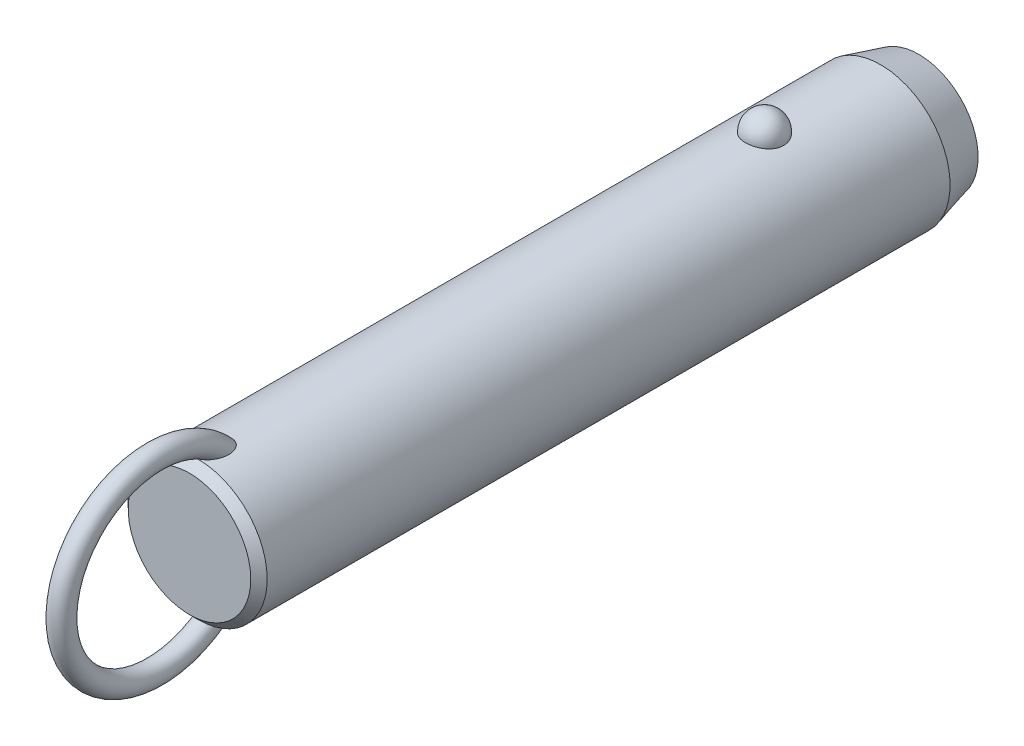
ISO-10303-21;
HEADER;
FILE_DESCRIPTION(('STEP AP214'),'2;1');
FILE_NAME('part.step','',(''),(''),'','','');
FILE_SCHEMA(('AUTOMOTIVE_DESIGN { 1 0 10303 214 1 1 1 1 }'));
ENDSEC;
DATA;
#1=APPLICATION_CONTEXT('core data for automotive mechanical design processes');
#2=APPLICATION_PROTOCOL_DEFINITION('international standard','automotive_design',2000,#1);
#3=PRODUCT_CONTEXT('',#1,'mechanical');
#4=PRODUCT('Part','Part','',(#3));
#5=PRODUCT_RELATED_PRODUCT_CATEGORY('part','',(#4));
#6=PRODUCT_DEFINITION_FORMATION('','',#4);
#7=PRODUCT_DEFINITION_CONTEXT('part definition',#1,'design');
#8=PRODUCT_DEFINITION('design','',#6,#7);
#9=PRODUCT_DEFINITION_SHAPE('','',#8);
#10=(LENGTH_UNIT() NAMED_UNIT(*) SI_UNIT(.MILLI.,.METRE.));
#11=(NAMED_UNIT(*) PLANE_ANGLE_UNIT() SI_UNIT($,.RADIAN.));
#12=(NAMED_UNIT(*) SI_UNIT($,.STERADIAN.) SOLID_ANGLE_UNIT());
#13=UNCERTAINTY_MEASURE_WITH_UNIT(LENGTH_MEASURE(1.E-05),#10,'distance_accuracy_value','');
#14=(GEOMETRIC_REPRESENTATION_CONTEXT(3) GLOBAL_UNCERTAINTY_ASSIGNED_CONTEXT((#13)) GLOBAL_UNIT_ASSIGNED_CONTEXT((#10,
#11,#12)) REPRESENTATION_CONTEXT('',''));
#15=CARTESIAN_POINT('',(0.,0.,0.));
#16=DIRECTION('',(0.,0.,1.));
#17=DIRECTION('',(1.,0.,0.));
#18=AXIS2_PLACEMENT_3D('',#15,#16,#17);
#19=CARTESIAN_POINT('',(0.,0.,88.9));
#20=DIRECTION('',(0.,0.,-1.));
#21=DIRECTION('',(-1.,0.,0.));
#22=AXIS2_PLACEMENT_3D('',#19,#20,#21);
#23=CYLINDRICAL_SURFACE('',#22,12.7);
#24=CARTESIAN_POINT('',(3.46661256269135,12.2177165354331,-3.5));
#25=CARTESIAN_POINT('',(3.4666090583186,12.2177194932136,-3.30432790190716));
#26=CARTESIAN_POINT('',(3.45063567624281,12.2222841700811,-3.10861112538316));
#27=CARTESIAN_POINT('',(3.38712451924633,12.2400345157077,-2.72271899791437));
#28=CARTESIAN_POINT('',(3.33957415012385,12.2532236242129,-2.53254588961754));
#29=CARTESIAN_POINT('',(3.2141234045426,12.286724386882,-2.16324948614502));
#30=CARTESIAN_POINT('',(3.13623639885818,12.3070329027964,-1.98412136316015));
#31=CARTESIAN_POINT('',(2.95205930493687,12.3525018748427,-1.64180592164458));
#32=CARTESIAN_POINT('',(2.84577003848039,12.3776621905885,-1.47861814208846));
#33=CARTESIAN_POINT('',(2.60688050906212,12.4301712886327,-1.17190583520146));
#34=CARTESIAN_POINT('',(2.47415697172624,12.4575299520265,-1.02847897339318));
#35=CARTESIAN_POINT('',(2.18615174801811,12.5112810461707,-0.766177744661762));
#36=CARTESIAN_POINT('',(2.03087002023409,12.5376734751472,-0.64730342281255));
#37=CARTESIAN_POINT('',(1.70237334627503,12.5864761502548,-0.437732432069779));
#38=CARTESIAN_POINT('',(1.52920948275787,12.6088972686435,-0.346958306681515));
#39=CARTESIAN_POINT('',(1.16944170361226,12.6473352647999,-0.195750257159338));
#40=CARTESIAN_POINT('',(0.982839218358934,12.663352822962,-0.135313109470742));
#41=CARTESIAN_POINT('',(0.604961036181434,12.6869706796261,-0.0473241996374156));
#42=CARTESIAN_POINT('',(0.41382314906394,12.6947125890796,-0.0192185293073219));
#43=CARTESIAN_POINT('',(0.0293827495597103,12.7014203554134,0.0051725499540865));
#44=CARTESIAN_POINT('',(-0.163919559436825,12.7003870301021,0.00146092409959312));
#45=CARTESIAN_POINT('',(-0.544374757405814,12.689735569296,-0.0373939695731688));
#46=CARTESIAN_POINT('',(-0.731575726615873,12.6802364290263,-0.0721015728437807));
#47=CARTESIAN_POINT('',(-1.09733277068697,12.6538333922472,-0.171364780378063));
#48=CARTESIAN_POINT('',(-1.27588869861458,12.6369293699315,-0.235920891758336));
#49=CARTESIAN_POINT('',(-1.6204698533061,12.5973946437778,-0.393548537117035));
#50=CARTESIAN_POINT('',(-1.78641865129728,12.5747321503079,-0.486778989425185));
#51=CARTESIAN_POINT('',(-2.10030671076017,12.5261316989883,-0.699110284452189));
#52=CARTESIAN_POINT('',(-2.24824419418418,12.5001934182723,-0.818213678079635));
#53=CARTESIAN_POINT('',(-2.52491489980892,12.4472906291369,-1.08157124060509));
#54=CARTESIAN_POINT('',(-2.65324222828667,12.4203160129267,-1.22624992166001));
#55=CARTESIAN_POINT('',(-2.88410007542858,12.3687509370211,-1.53528325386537));
#56=CARTESIAN_POINT('',(-2.98662883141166,12.3441606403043,-1.69963924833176));
#57=CARTESIAN_POINT('',(-3.16432417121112,12.2998199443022,-2.04548497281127));
#58=CARTESIAN_POINT('',(-3.23917525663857,12.2801261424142,-2.22714424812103));
#59=CARTESIAN_POINT('',(-3.35800573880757,12.248167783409,-2.6009138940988));
#60=CARTESIAN_POINT('',(-3.4019860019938,12.2359030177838,-2.79302397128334));
#61=CARTESIAN_POINT('',(-3.45784812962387,12.2202347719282,-3.18140279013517));
#62=CARTESIAN_POINT('',(-3.46986123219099,12.2167950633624,-3.37765118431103));
#63=CARTESIAN_POINT('',(-3.46186273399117,12.2190638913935,-3.76943689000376));
#64=CARTESIAN_POINT('',(-3.44185196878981,12.2247721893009,-3.96497421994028));
#65=CARTESIAN_POINT('',(-3.37048652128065,12.2446381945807,-4.34881728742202));
#66=CARTESIAN_POINT('',(-3.31928253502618,12.2587552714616,-4.53715319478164));
#67=CARTESIAN_POINT('',(-3.18693461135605,12.2938237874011,-4.90231727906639));
#68=CARTESIAN_POINT('',(-3.1057895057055,12.3147754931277,-5.07914500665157));
#69=CARTESIAN_POINT('',(-2.91506431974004,12.3613125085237,-5.41732059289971));
#70=CARTESIAN_POINT('',(-2.80533587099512,12.3869217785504,-5.57858147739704));
#71=CARTESIAN_POINT('',(-2.560414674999,12.4398525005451,-5.88013283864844));
#72=CARTESIAN_POINT('',(-2.42522099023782,12.4671740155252,-6.02042254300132));
#73=CARTESIAN_POINT('',(-2.1323357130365,12.5205965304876,-6.27662798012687));
#74=CARTESIAN_POINT('',(-1.97456596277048,12.5466928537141,-6.3924554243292));
#75=CARTESIAN_POINT('',(-1.64115839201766,12.5946384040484,-6.59583547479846));
#76=CARTESIAN_POINT('',(-1.46552179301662,12.6164879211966,-6.68339001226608));
#77=CARTESIAN_POINT('',(-1.10356050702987,12.6532533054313,-6.82682153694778));
#78=CARTESIAN_POINT('',(-0.9173913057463,12.6682500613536,-6.8830698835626));
#79=CARTESIAN_POINT('',(-0.537836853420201,12.6900288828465,-6.96386887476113));
#80=CARTESIAN_POINT('',(-0.344452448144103,12.6968119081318,-6.9884232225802));
#81=CARTESIAN_POINT('',(0.0402577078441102,12.7013667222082,-7.00496469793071));
#82=CARTESIAN_POINT('',(0.231556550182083,12.6993008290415,-6.99753844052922));
#83=CARTESIAN_POINT('',(0.610105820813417,12.6867505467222,-6.9516636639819));
#84=CARTESIAN_POINT('',(0.797356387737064,12.6762664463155,-6.913216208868));
#85=CARTESIAN_POINT('',(1.16186657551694,12.6480587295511,-6.80658431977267));
#86=CARTESIAN_POINT('',(1.33915951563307,12.6303611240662,-6.73850666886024));
#87=CARTESIAN_POINT('',(1.67968518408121,12.5896027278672,-6.5745087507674));
#88=CARTESIAN_POINT('',(1.84291705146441,12.5665416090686,-6.47858678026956));
#89=CARTESIAN_POINT('',(2.15340192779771,12.5171072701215,-6.25982455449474));
#90=CARTESIAN_POINT('',(2.30037831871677,12.4906895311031,-6.13660186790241));
#91=CARTESIAN_POINT('',(2.5717412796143,12.4376567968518,-5.86739587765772));
#92=CARTESIAN_POINT('',(2.69612388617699,12.4110417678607,-5.72140858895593));
#93=CARTESIAN_POINT('',(2.92107785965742,12.360051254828,-5.40794137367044));
#94=CARTESIAN_POINT('',(3.02121329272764,12.3357209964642,-5.24014110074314));
#95=CARTESIAN_POINT('',(3.19236291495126,12.2925446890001,-4.88969865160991));
#96=CARTESIAN_POINT('',(3.26338839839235,12.2736965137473,-4.70706226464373));
#97=CARTESIAN_POINT('',(3.36788038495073,12.245404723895,-4.35469510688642));
#98=CARTESIAN_POINT('',(3.40484026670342,12.2351018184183,-4.18605935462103));
#99=CARTESIAN_POINT('',(3.45420764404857,12.2212564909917,-3.84496058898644));
#100=CARTESIAN_POINT('',(3.46661565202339,12.2177139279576,-3.67249765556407));
#101=CARTESIAN_POINT('',(3.46661256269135,12.2177165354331,-3.5));
#102=B_SPLINE_CURVE_WITH_KNOTS('',3,(#24,#25,#26,#27,#28,#29,#30,#31,#32,#33,#34,#35,#36,#37,
#38,#39,#40,#41,#42,#43,#44,#45,#46,#47,#48,#49,#50,#51,#52,#53,#54,#55,#56,#57,#58,#59,#60,#61,
#62,#63,#64,#65,#66,#67,#68,#69,#70,#71,#72,#73,#74,#75,#76,#77,#78,#79,#80,#81,#82,#83,#84,#85,
#86,#87,#88,#89,#90,#91,#92,#93,#94,#95,#96,#97,#98,#99,#100,#101),.UNSPECIFIED.,.T.,.F.,(4,2,2,
2,2,2,2,2,2,2,2,2,2,2,2,2,2,2,2,2,2,2,2,2,2,2,2,2,2,2,2,2,2,2,2,2,2,2,4),(0.,0.586396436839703,
1.17302689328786,1.7593990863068,2.34575431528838,2.93491084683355,3.52406845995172,
4.11158733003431,4.69904375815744,5.2762784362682,5.85345931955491,6.42265312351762,
6.99185659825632,7.56427334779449,8.136746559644,8.71981013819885,9.3029135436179,
9.89247258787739,10.4820150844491,11.0691335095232,11.6562366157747,12.2405256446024,
12.8248374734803,13.412244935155,13.9996740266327,14.5891883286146,15.1786623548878,
15.7609861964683,16.3432419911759,16.9148635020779,17.4864654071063,18.0560241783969,
18.6256177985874,19.2037609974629,19.7820055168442,20.3699810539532,20.957728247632,
21.4746855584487,21.9916320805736),.UNSPECIFIED.);
#103=CARTESIAN_POINT('',(3.46661256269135,12.2177165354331,-3.5));
#104=VERTEX_POINT('',#103);
#105=EDGE_CURVE('E41',#104,#104,#102,.T.);
#106=ORIENTED_EDGE('',*,*,#105,.T.);
#107=EDGE_LOOP('',(#106));
#108=FACE_BOUND('',#107,.T.);
#109=CARTESIAN_POINT('',(0.,0.,100.1));
#110=DIRECTION('',(0.,0.,1.));
#111=DIRECTION('',(1.,0.,0.));
#112=AXIS2_PLACEMENT_3D('',#109,#110,#111);
#113=CIRCLE('',#112,12.7);
#114=CARTESIAN_POINT('',(12.7,0.,100.1));
#115=VERTEX_POINT('',#114);
#116=EDGE_CURVE('E10',#115,#115,#113,.F.);
#117=ORIENTED_EDGE('',*,*,#116,.T.);
#118=EDGE_LOOP('',(#117));
#119=FACE_BOUND('',#118,.T.);
#120=CARTESIAN_POINT('',(-0.548122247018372,-12.6881662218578,93.8432187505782));
#121=CARTESIAN_POINT('',(-0.648865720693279,-12.6838128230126,93.877926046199));
#122=CARTESIAN_POINT('',(-0.746398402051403,-12.6783867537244,93.9220428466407));
#123=CARTESIAN_POINT('',(-0.93212506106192,-12.666091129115,94.0267647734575));
#124=CARTESIAN_POINT('',(-1.02030388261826,-12.6592192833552,94.087396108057));
#125=CARTESIAN_POINT('',(-1.18487740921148,-12.6448747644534,94.221847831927));
#126=CARTESIAN_POINT('',(-1.26134296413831,-12.637406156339,94.2955825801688));
#127=CARTESIAN_POINT('',(-1.4023120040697,-12.6225412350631,94.4536045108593));
#128=CARTESIAN_POINT('',(-1.46681470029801,-12.6151449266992,94.5378923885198));
#129=CARTESIAN_POINT('',(-1.60714786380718,-12.5981718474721,94.7496577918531));
#130=CARTESIAN_POINT('',(-1.67725126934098,-12.588900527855,94.880962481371));
#131=CARTESIAN_POINT('',(-1.79536591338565,-12.5725964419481,95.1532471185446));
#132=CARTESIAN_POINT('',(-1.84333535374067,-12.5655679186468,95.2942447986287));
#133=CARTESIAN_POINT('',(-1.93422576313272,-12.5519624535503,95.6376455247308));
#134=CARTESIAN_POINT('',(-1.96788773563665,-12.5466298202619,95.8425578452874));
#135=CARTESIAN_POINT('',(-1.9941399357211,-12.542463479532,96.1517600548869));
#136=CARTESIAN_POINT('',(-1.99883864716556,-12.5417153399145,96.2552987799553));
#137=CARTESIAN_POINT('',(-2.00078003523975,-12.5414074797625,96.4624512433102));
#138=CARTESIAN_POINT('',(-1.99802449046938,-12.5418474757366,96.5660649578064));
#139=CARTESIAN_POINT('',(-1.98336733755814,-12.5441750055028,96.8103207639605));
#140=CARTESIAN_POINT('',(-1.96851430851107,-12.5465291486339,96.9507804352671));
#141=CARTESIAN_POINT('',(-1.92707089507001,-12.5529612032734,97.2299607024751));
#142=CARTESIAN_POINT('',(-1.90047458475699,-12.5570399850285,97.3686803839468));
#143=CARTESIAN_POINT('',(-1.83619120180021,-12.5666008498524,97.6434113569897));
#144=CARTESIAN_POINT('',(-1.79850828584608,-12.57208240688,97.7794236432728));
#145=CARTESIAN_POINT('',(-1.71223796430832,-12.5841228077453,98.0478421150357));
#146=CARTESIAN_POINT('',(-1.66365679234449,-12.5906810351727,98.1802503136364));
#147=CARTESIAN_POINT('',(-1.5780450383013,-12.6016176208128,98.3854887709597));
#148=CARTESIAN_POINT('',(-1.54477252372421,-12.6057501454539,98.4599149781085));
#149=CARTESIAN_POINT('',(-1.47424480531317,-12.6141930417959,98.6068393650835));
#150=CARTESIAN_POINT('',(-1.43699041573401,-12.6185033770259,98.6793379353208));
#151=CARTESIAN_POINT('',(-1.35825795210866,-12.6272207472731,98.8218926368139));
#152=CARTESIAN_POINT('',(-1.31678520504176,-12.6316276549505,98.8919517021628));
#153=CARTESIAN_POINT('',(-1.22917793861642,-12.6404532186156,99.0290705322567));
#154=CARTESIAN_POINT('',(-1.18304514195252,-12.6448718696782,99.0961313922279));
#155=CARTESIAN_POINT('',(-1.07246411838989,-12.6547893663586,99.2438741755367));
#156=CARTESIAN_POINT('',(-1.00642239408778,-12.6602600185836,99.3233844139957));
#157=CARTESIAN_POINT('',(-0.864441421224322,-12.6707460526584,99.4731698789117));
#158=CARTESIAN_POINT('',(-0.788516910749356,-12.6757620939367,99.5434585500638));
#159=CARTESIAN_POINT('',(-0.652215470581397,-12.6833591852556,99.6486801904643));
#160=CARTESIAN_POINT('',(-0.594982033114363,-12.6861973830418,99.6876241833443));
#161=CARTESIAN_POINT('',(-0.475269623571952,-12.6912445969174,99.7564899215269));
#162=CARTESIAN_POINT('',(-0.412800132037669,-12.6934547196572,99.7864275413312));
#163=CARTESIAN_POINT('',(-0.295749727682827,-12.6966636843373,99.8297565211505));
#164=CARTESIAN_POINT('',(-0.241949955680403,-12.6978134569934,99.8452188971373));
#165=CARTESIAN_POINT('',(-0.132508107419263,-12.6994261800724,99.8668845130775));
#166=CARTESIAN_POINT('',(-0.0768679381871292,-12.6998898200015,99.8730970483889));
#167=CARTESIAN_POINT('',(0.0347696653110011,-12.7000752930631,99.8755838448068));
#168=CARTESIAN_POINT('',(0.0907676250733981,-12.6997954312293,99.8718353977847));
#169=CARTESIAN_POINT('',(0.201283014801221,-12.6985255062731,99.8547883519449));
#170=CARTESIAN_POINT('',(0.255799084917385,-12.6975348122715,99.8414812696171));
#171=CARTESIAN_POINT('',(0.376042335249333,-12.6946091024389,99.8020379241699));
#172=CARTESIAN_POINT('',(0.44095085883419,-12.6924943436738,99.7734492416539));
#173=CARTESIAN_POINT('',(0.565350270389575,-12.6875639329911,99.7063234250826));
#174=CARTESIAN_POINT('',(0.624828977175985,-12.6847467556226,99.6677646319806));
#175=CARTESIAN_POINT('',(0.774116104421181,-12.6767252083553,99.556949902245));
#176=CARTESIAN_POINT('',(0.859449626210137,-12.6711344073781,99.4787605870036));
#177=CARTESIAN_POINT('',(1.01789440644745,-12.6593922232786,99.310943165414));
#178=CARTESIAN_POINT('',(1.09096902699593,-12.653239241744,99.221282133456));
#179=CARTESIAN_POINT('',(1.22268793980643,-12.6411674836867,99.0402658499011));
#180=CARTESIAN_POINT('',(1.28193986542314,-12.6352572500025,98.949345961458));
#181=CARTESIAN_POINT('',(1.39259777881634,-12.6235401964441,98.7627929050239));
#182=CARTESIAN_POINT('',(1.44399707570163,-12.6177334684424,98.6671558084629));
#183=CARTESIAN_POINT('',(1.53972870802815,-12.6064093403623,98.4722738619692));
#184=CARTESIAN_POINT('',(1.58405262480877,-12.6008922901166,98.3730248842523));
#185=CARTESIAN_POINT('',(1.66600705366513,-12.5903187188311,98.1717727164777));
#186=CARTESIAN_POINT('',(1.70363651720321,-12.5852622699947,98.0697690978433));
#187=CARTESIAN_POINT('',(1.77545379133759,-12.5753406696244,97.8543580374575));
#188=CARTESIAN_POINT('',(1.80903453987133,-12.5705328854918,97.740745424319));
#189=CARTESIAN_POINT('',(1.86844163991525,-12.5618400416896,97.5114575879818));
#190=CARTESIAN_POINT('',(1.89426665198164,-12.5579551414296,97.3957820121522));
#191=CARTESIAN_POINT('',(1.9378546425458,-12.5513030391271,97.1630072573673));
#192=CARTESIAN_POINT('',(1.9556264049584,-12.5485346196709,97.0459097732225));
#193=CARTESIAN_POINT('',(1.98264463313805,-12.5442934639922,96.8107473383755));
#194=CARTESIAN_POINT('',(1.99189298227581,-12.5428204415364,96.6926826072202));
#195=CARTESIAN_POINT('',(2.00416068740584,-12.540871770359,96.3806225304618));
#196=CARTESIAN_POINT('',(1.99944433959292,-12.541631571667,96.1862290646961));
#197=CARTESIAN_POINT('',(1.96113755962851,-12.5476846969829,95.8003095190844));
#198=CARTESIAN_POINT('',(1.92758341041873,-12.5529723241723,95.6087801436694));
#199=CARTESIAN_POINT('',(1.83934342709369,-12.5661532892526,95.2822728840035));
#200=CARTESIAN_POINT('',(1.79215440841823,-12.5730485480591,95.1452499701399));
#201=CARTESIAN_POINT('',(1.67676242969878,-12.588958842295,94.8804459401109));
#202=CARTESIAN_POINT('',(1.60859050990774,-12.597970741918,94.7526515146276));
#203=CARTESIAN_POINT('',(1.46583832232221,-12.6152829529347,94.5358006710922));
#204=CARTESIAN_POINT('',(1.39525727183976,-12.6233659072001,94.4441050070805));
#205=CARTESIAN_POINT('',(1.23992594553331,-12.6395676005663,94.2734854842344));
#206=CARTESIAN_POINT('',(1.1551793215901,-12.6476863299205,94.1945583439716));
#207=CARTESIAN_POINT('',(0.971995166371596,-12.6630846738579,94.0526438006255));
#208=CARTESIAN_POINT('',(0.873456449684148,-12.6703572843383,93.9897849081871));
#209=CARTESIAN_POINT('',(0.665847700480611,-12.6829569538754,93.8844870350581));
#210=CARTESIAN_POINT('',(0.556784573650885,-12.688285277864,93.8420347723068));
#211=CARTESIAN_POINT('',(0.347338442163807,-12.6956226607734,93.7844434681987));
#212=CARTESIAN_POINT('',(0.247759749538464,-12.6979816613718,93.7663996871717));
#213=CARTESIAN_POINT('',(0.0470218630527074,-12.7003077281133,93.7486007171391));
#214=CARTESIAN_POINT('',(-0.0541350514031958,-12.7002779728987,93.7488212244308));
#215=CARTESIAN_POINT('',(-0.221414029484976,-12.6982482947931,93.7643639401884));
#216=CARTESIAN_POINT('',(-0.288055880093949,-12.6969033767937,93.7746662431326));
#217=CARTESIAN_POINT('',(-0.419599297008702,-12.6932369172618,93.8031348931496));
#218=CARTESIAN_POINT('',(-0.484501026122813,-12.6909154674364,93.8213005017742));
#219=CARTESIAN_POINT('',(-0.548122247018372,-12.6881662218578,93.8432187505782));
#220=B_SPLINE_CURVE_WITH_KNOTS('',3,(#120,#121,#122,#123,#124,#125,#126,#127,#128,#129,#130,
#131,#132,#133,#134,#135,#136,#137,#138,#139,#140,#141,#142,#143,#144,#145,#146,#147,#148,#149,
#150,#151,#152,#153,#154,#155,#156,#157,#158,#159,#160,#161,#162,#163,#164,#165,#166,#167,#168,
#169,#170,#171,#172,#173,#174,#175,#176,#177,#178,#179,#180,#181,#182,#183,#184,#185,#186,#187,
#188,#189,#190,#191,#192,#193,#194,#195,#196,#197,#198,#199,#200,#201,#202,#203,#204,#205,#206,
#207,#208,#209,#210,#211,#212,#213,#214,#215,#216,#217,#218,#219),.UNSPECIFIED.,.T.,.F.,(4,2,2,
2,2,2,2,2,2,2,2,2,2,2,2,2,2,2,2,2,2,2,2,2,2,2,2,2,2,2,2,2,2,2,2,2,2,2,2,2,2,2,2,2,2,2,2,2,2,4),
(0.,0.31964225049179,0.639794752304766,0.957927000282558,1.27608021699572,1.72100165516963,
2.16675988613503,2.78630021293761,3.09705782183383,3.40774128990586,3.83096358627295,
4.2543996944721,4.67767724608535,5.10071330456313,5.34550297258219,5.59024267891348,
5.83467707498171,6.07902143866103,6.38891080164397,6.69834321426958,6.90560910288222,
7.11250749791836,7.27977315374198,7.44687060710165,7.61434932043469,7.78197685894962,
7.99365544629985,8.20579780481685,8.55147335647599,8.89816429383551,9.22375138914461,
9.5496143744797,9.87586224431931,10.202161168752,10.557587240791,10.9130746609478,
11.2681734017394,11.6231936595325,12.2046601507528,12.7853961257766,13.219164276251,
13.6522938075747,13.9989174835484,14.3454519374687,14.6946768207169,15.0436740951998,
15.3457513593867,15.6474266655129,15.8493051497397,16.0511646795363),.UNSPECIFIED.);
#221=CARTESIAN_POINT('',(-0.548122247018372,-12.6881662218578,93.8432187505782));
#222=VERTEX_POINT('',#221);
#223=EDGE_CURVE('E58',#222,#222,#220,.T.);
#224=ORIENTED_EDGE('',*,*,#223,.T.);
#225=EDGE_LOOP('',(#224));
#226=FACE_BOUND('',#225,.T.);
#227=CARTESIAN_POINT('',(-0.548122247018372,12.6881662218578,93.8432187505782));
#228=CARTESIAN_POINT('',(-0.459436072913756,12.6919968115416,93.812673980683));
#229=CARTESIAN_POINT('',(-0.368189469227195,12.6949996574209,93.7893913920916));
#230=CARTESIAN_POINT('',(-0.183024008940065,12.6990186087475,93.7584062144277));
#231=CARTESIAN_POINT('',(-0.0891049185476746,12.7000345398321,93.7507049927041));
#232=CARTESIAN_POINT('',(0.0987147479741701,12.6999636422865,93.7512455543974));
#233=CARTESIAN_POINT('',(0.192615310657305,12.6988761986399,93.7594920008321));
#234=CARTESIAN_POINT('',(0.377658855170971,12.6947211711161,93.7915515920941));
#235=CARTESIAN_POINT('',(0.468801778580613,12.6916535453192,93.8153650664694));
#236=CARTESIAN_POINT('',(0.645809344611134,12.6838788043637,93.8774565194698));
#237=CARTESIAN_POINT('',(0.731679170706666,12.6791733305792,93.915720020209));
#238=CARTESIAN_POINT('',(0.896315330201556,12.6686004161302,94.0051204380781));
#239=CARTESIAN_POINT('',(0.975080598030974,12.6627328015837,94.0562592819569));
#240=CARTESIAN_POINT('',(1.12963655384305,12.6499161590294,94.1736782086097));
#241=CARTESIAN_POINT('',(1.20478673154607,12.6429194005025,94.2407929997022));
#242=CARTESIAN_POINT('',(1.34448241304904,12.6288282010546,94.3852250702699));
#243=CARTESIAN_POINT('',(1.40902173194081,12.621733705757,94.4625482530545));
#244=CARTESIAN_POINT('',(1.55208211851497,12.6050877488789,94.6592475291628));
#245=CARTESIAN_POINT('',(1.62510490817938,12.5957546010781,94.7826540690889));
#246=CARTESIAN_POINT('',(1.75019044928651,12.5789823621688,95.0397690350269));
#247=CARTESIAN_POINT('',(1.80221377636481,12.5715468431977,95.173496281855));
#248=CARTESIAN_POINT('',(1.90309965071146,12.5567434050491,95.4983516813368));
#249=CARTESIAN_POINT('',(1.94342317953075,12.5504515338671,95.6921611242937));
#250=CARTESIAN_POINT('',(1.99332997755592,12.5426147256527,96.0837881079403));
#251=CARTESIAN_POINT('',(2.00285305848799,12.5410790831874,96.2816127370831));
#252=CARTESIAN_POINT('',(1.99678999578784,12.5420407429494,96.6166427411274));
#253=CARTESIAN_POINT('',(1.98794117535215,12.5434564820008,96.7540428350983));
#254=CARTESIAN_POINT('',(1.95865119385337,12.5480641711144,97.0276394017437));
#255=CARTESIAN_POINT('',(1.93820436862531,12.5512569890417,97.1638352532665));
#256=CARTESIAN_POINT('',(1.88647896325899,12.5591352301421,97.4342493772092));
#257=CARTESIAN_POINT('',(1.85518800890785,12.5638223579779,97.5684652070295));
#258=CARTESIAN_POINT('',(1.78217886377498,12.5743868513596,97.8339362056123));
#259=CARTESIAN_POINT('',(1.74046509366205,12.5802637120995,97.9651926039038));
#260=CARTESIAN_POINT('',(1.66024095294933,12.5910571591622,98.1860855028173));
#261=CARTESIAN_POINT('',(1.62434772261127,12.5957535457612,98.2766904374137));
#262=CARTESIAN_POINT('',(1.5470900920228,12.6054762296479,98.4555125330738));
#263=CARTESIAN_POINT('',(1.50572681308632,12.6105024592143,98.5437301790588));
#264=CARTESIAN_POINT('',(1.41728020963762,12.620748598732,98.7169321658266));
#265=CARTESIAN_POINT('',(1.37021377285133,12.625967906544,98.8019251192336));
#266=CARTESIAN_POINT('',(1.2696962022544,12.6364721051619,98.9680072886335));
#267=CARTESIAN_POINT('',(1.21624929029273,12.6417569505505,99.0490990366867));
#268=CARTESIAN_POINT('',(1.10304413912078,12.6521331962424,99.2047027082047));
#269=CARTESIAN_POINT('',(1.04340936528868,12.657226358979,99.2793033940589));
#270=CARTESIAN_POINT('',(0.91591933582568,12.6670906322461,99.421324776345));
#271=CARTESIAN_POINT('',(0.84806456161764,12.6718617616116,99.4887458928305));
#272=CARTESIAN_POINT('',(0.717035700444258,12.67987711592,99.6006247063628));
#273=CARTESIAN_POINT('',(0.655526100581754,12.6832377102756,99.6469970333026));
#274=CARTESIAN_POINT('',(0.525985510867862,12.6892676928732,99.7296195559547));
#275=CARTESIAN_POINT('',(0.45796984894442,12.6919386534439,99.7658927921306));
#276=CARTESIAN_POINT('',(0.334859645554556,12.695691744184,99.8166572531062));
#277=CARTESIAN_POINT('',(0.281116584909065,12.6970073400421,99.8343733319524));
#278=CARTESIAN_POINT('',(0.171425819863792,12.6989609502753,99.8606429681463));
#279=CARTESIAN_POINT('',(0.11548082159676,12.699599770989,99.8692074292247));
#280=CARTESIAN_POINT('',(0.00272618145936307,12.7001251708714,99.8762531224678));
#281=CARTESIAN_POINT('',(-0.0540859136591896,12.7000089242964,99.8746964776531));
#282=CARTESIAN_POINT('',(-0.166544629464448,12.6990328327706,99.8616005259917));
#283=CARTESIAN_POINT('',(-0.222190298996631,12.6981724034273,99.8500533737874));
#284=CARTESIAN_POINT('',(-0.342018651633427,12.695562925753,99.8149128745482));
#285=CARTESIAN_POINT('',(-0.405606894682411,12.6936676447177,99.7893322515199));
#286=CARTESIAN_POINT('',(-0.527815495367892,12.6891754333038,99.728311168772));
#287=CARTESIAN_POINT('',(-0.586425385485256,12.6865770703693,99.6928505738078));
#288=CARTESIAN_POINT('',(-0.731842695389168,12.6792129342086,99.5914960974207));
#289=CARTESIAN_POINT('',(-0.814709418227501,12.6740767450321,99.5200395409));
#290=CARTESIAN_POINT('',(-0.969101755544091,12.6632083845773,99.3658900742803));
#291=CARTESIAN_POINT('',(-1.04059564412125,12.6574746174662,99.2831668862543));
#292=CARTESIAN_POINT('',(-1.16981116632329,12.6461638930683,99.1158096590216));
#293=CARTESIAN_POINT('',(-1.22811369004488,12.6405994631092,99.0316166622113));
#294=CARTESIAN_POINT('',(-1.33743405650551,12.6295007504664,98.8585791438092));
#295=CARTESIAN_POINT('',(-1.38844577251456,12.6239664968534,98.7697307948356));
#296=CARTESIAN_POINT('',(-1.48400702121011,12.6130898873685,98.588389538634));
#297=CARTESIAN_POINT('',(-1.52854232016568,12.6077479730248,98.4958891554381));
#298=CARTESIAN_POINT('',(-1.6115011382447,12.5974127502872,98.3081607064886));
#299=CARTESIAN_POINT('',(-1.64992317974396,12.5924195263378,98.2129319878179));
#300=CARTESIAN_POINT('',(-1.73468589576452,12.581070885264,97.9828936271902));
#301=CARTESIAN_POINT('',(-1.77831261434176,12.5749388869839,97.8470661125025));
#302=CARTESIAN_POINT('',(-1.85439734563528,12.5639437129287,97.5722128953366));
#303=CARTESIAN_POINT('',(-1.88684994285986,12.5590811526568,97.4331856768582));
#304=CARTESIAN_POINT('',(-1.94008483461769,12.550968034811,97.1530923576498));
#305=CARTESIAN_POINT('',(-1.96088706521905,12.5477147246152,97.0120301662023));
#306=CARTESIAN_POINT('',(-1.99000539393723,12.5431291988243,96.7286689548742));
#307=CARTESIAN_POINT('',(-1.99832911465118,12.5417958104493,96.5863707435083));
#308=CARTESIAN_POINT('',(-2.00166624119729,12.5412674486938,96.2576271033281));
#309=CARTESIAN_POINT('',(-1.99178843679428,12.5428579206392,96.071088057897));
#310=CARTESIAN_POINT('',(-1.9445518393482,12.5502731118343,95.7016240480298));
#311=CARTESIAN_POINT('',(-1.90724032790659,12.5560905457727,95.5186934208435));
#312=CARTESIAN_POINT('',(-1.81330718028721,12.5699462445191,95.2048488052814));
#313=CARTESIAN_POINT('',(-1.76338820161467,12.5771273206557,95.0719105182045));
#314=CARTESIAN_POINT('',(-1.64305018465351,12.593414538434,94.8156813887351));
#315=CARTESIAN_POINT('',(-1.57265346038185,12.6025185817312,94.692380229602));
#316=CARTESIAN_POINT('',(-1.42634956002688,12.6198178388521,94.4835648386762));
#317=CARTESIAN_POINT('',(-1.35423772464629,12.6278405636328,94.3953846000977));
#318=CARTESIAN_POINT('',(-1.19645664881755,12.6437632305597,94.232107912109));
#319=CARTESIAN_POINT('',(-1.11080536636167,12.6516633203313,94.1569944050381));
#320=CARTESIAN_POINT('',(-0.947219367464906,12.6648319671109,94.0378114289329));
#321=CARTESIAN_POINT('',(-0.871624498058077,12.670300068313,93.9905414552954));
#322=CARTESIAN_POINT('',(-0.714161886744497,12.6801492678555,93.9077413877));
#323=CARTESIAN_POINT('',(-0.632295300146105,12.684530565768,93.8722091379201));
#324=CARTESIAN_POINT('',(-0.548122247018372,12.6881662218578,93.8432187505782));
#325=B_SPLINE_CURVE_WITH_KNOTS('',3,(#227,#228,#229,#230,#231,#232,#233,#234,#235,#236,#237,
#238,#239,#240,#241,#242,#243,#244,#245,#246,#247,#248,#249,#250,#251,#252,#253,#254,#255,#256,
#257,#258,#259,#260,#261,#262,#263,#264,#265,#266,#267,#268,#269,#270,#271,#272,#273,#274,#275,
#276,#277,#278,#279,#280,#281,#282,#283,#284,#285,#286,#287,#288,#289,#290,#291,#292,#293,#294,
#295,#296,#297,#298,#299,#300,#301,#302,#303,#304,#305,#306,#307,#308,#309,#310,#311,#312,#313,
#314,#315,#316,#317,#318,#319,#320,#321,#322,#323,#324),.UNSPECIFIED.,.T.,.F.,(4,2,2,2,2,2,2,2,
2,2,2,2,2,2,2,2,2,2,2,2,2,2,2,2,2,2,2,2,2,2,2,2,2,2,2,2,2,2,2,2,2,2,2,2,2,2,2,2,4),(0.,
0.281328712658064,0.562682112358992,0.844117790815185,1.12555942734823,1.40671982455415,
1.68792232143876,1.98972294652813,2.29169886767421,2.72039860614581,3.14989948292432,
3.74084916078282,4.33295293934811,4.74554109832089,5.15833092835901,5.57159335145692,
5.98468079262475,6.2772277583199,6.56971484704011,6.86135609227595,7.15280542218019,
7.43927407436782,7.72572595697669,7.95635862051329,8.18646071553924,8.35559393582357,
8.52452541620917,8.69408946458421,8.86378678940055,9.06834348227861,9.27332014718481,
9.60010414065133,9.92778432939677,10.2350252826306,10.5425229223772,10.8506864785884,
11.1589244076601,11.5867893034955,12.0148612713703,12.4421984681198,12.8692745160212,
13.4279365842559,13.9856380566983,14.4107062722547,14.8353130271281,15.1765567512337,
15.5173516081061,15.7844129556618,16.051425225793),.UNSPECIFIED.);
#326=CARTESIAN_POINT('',(-0.548122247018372,12.6881662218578,93.8432187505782));
#327=VERTEX_POINT('',#326);
#328=EDGE_CURVE('E66',#327,#327,#325,.T.);
#329=ORIENTED_EDGE('',*,*,#328,.T.);
#330=EDGE_LOOP('',(#329));
#331=FACE_BOUND('',#330,.T.);
#332=CARTESIAN_POINT('',(0.,0.,-24.6999999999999));
#333=DIRECTION('',(0.,0.,-1.));
#334=DIRECTION('',(-1.,0.,0.));
#335=AXIS2_PLACEMENT_3D('',#332,#333,#334);
#336=CIRCLE('',#335,12.7);
#337=CARTESIAN_POINT('',(-12.7,0.,-24.6999999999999));
#338=VERTEX_POINT('',#337);
#339=EDGE_CURVE('E55',#338,#338,#336,.F.);
#340=ORIENTED_EDGE('',*,*,#339,.T.);
#341=EDGE_LOOP('',(#340));
#342=FACE_BOUND('',#341,.T.);
#343=ADVANCED_FACE('F37',(#108,#119,#226,#331,#342),#23,.T.);
#344=CARTESIAN_POINT('',(0.,0.,-31.7));
#345=DIRECTION('',(0.,0.,-1.));
#346=DIRECTION('',(-1.,0.,0.));
#347=AXIS2_PLACEMENT_3D('',#344,#345,#346);
#348=PLANE('',#347);
#349=CARTESIAN_POINT('',(0.,0.,-31.7));
#350=DIRECTION('',(0.,0.,-1.));
#351=DIRECTION('',(-1.,0.,0.));
#352=AXIS2_PLACEMENT_3D('',#349,#350,#351);
#353=CIRCLE('',#352,10.8243556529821);
#354=CARTESIAN_POINT('',(-10.8243556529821,0.,-31.7));
#355=VERTEX_POINT('',#354);
#356=EDGE_CURVE('E65',#355,#355,#353,.T.);
#357=ORIENTED_EDGE('',*,*,#356,.T.);
#358=EDGE_LOOP('',(#357));
#359=FACE_BOUND('',#358,.T.);
#360=ADVANCED_FACE('F84',(#359),#348,.T.);
#361=CARTESIAN_POINT('',(0.,0.,-31.7));
#362=DIRECTION('',(0.,0.,1.));
#363=DIRECTION('',(1.,0.,0.));
#364=AXIS2_PLACEMENT_3D('',#361,#362,#363);
#365=CONICAL_SURFACE('',#364,10.8243556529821,0.261799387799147);
#366=ORIENTED_EDGE('',*,*,#339,.F.);
#367=EDGE_LOOP('',(#366));
#368=FACE_BOUND('',#367,.T.);
#369=ORIENTED_EDGE('',*,*,#356,.F.);
#370=EDGE_LOOP('',(#369));
#371=FACE_BOUND('',#370,.T.);
#372=ADVANCED_FACE('F82',(#368,#371),#365,.T.);
#373=CARTESIAN_POINT('',(0.,0.,101.6));
#374=DIRECTION('',(0.,0.,1.));
#375=DIRECTION('',(1.,0.,0.));
#376=AXIS2_PLACEMENT_3D('',#373,#374,#375);
#377=PLANE('',#376);
#378=CARTESIAN_POINT('',(0.,0.,101.6));
#379=DIRECTION('',(0.,0.,1.));
#380=DIRECTION('',(1.,0.,0.));
#381=AXIS2_PLACEMENT_3D('',#378,#379,#380);
#382=CIRCLE('',#381,11.2);
#383=CARTESIAN_POINT('',(11.2,0.,101.6));
#384=VERTEX_POINT('',#383);
#385=EDGE_CURVE('E50',#384,#384,#382,.T.);
#386=ORIENTED_EDGE('',*,*,#385,.T.);
#387=EDGE_LOOP('',(#386));
#388=FACE_BOUND('',#387,.T.);
#389=ADVANCED_FACE('F76',(#388),#377,.T.);
#390=CARTESIAN_POINT('',(0.,0.,107.95));
#391=DIRECTION('',(1.,0.,0.));
#392=DIRECTION('',(0.,0.,-1.));
#393=AXIS2_PLACEMENT_3D('',#390,#391,#392);
#394=TOROIDAL_SURFACE('',#393,17.05,2.);
#395=ORIENTED_EDGE('',*,*,#328,.F.);
#396=EDGE_LOOP('',(#395));
#397=FACE_BOUND('',#396,.T.);
#398=ORIENTED_EDGE('',*,*,#223,.F.);
#399=EDGE_LOOP('',(#398));
#400=FACE_BOUND('',#399,.T.);
#401=ADVANCED_FACE('F72',(#397,#400),#394,.T.);
#402=CARTESIAN_POINT('',(0.,0.,101.6));
#403=DIRECTION('',(0.,0.,-1.));
#404=DIRECTION('',(-1.,0.,0.));
#405=AXIS2_PLACEMENT_3D('',#402,#403,#404);
#406=CONICAL_SURFACE('',#405,11.2,0.785398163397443);
#407=ORIENTED_EDGE('',*,*,#116,.F.);
#408=EDGE_LOOP('',(#407));
#409=FACE_BOUND('',#408,.T.);
#410=ORIENTED_EDGE('',*,*,#385,.F.);
#411=EDGE_LOOP('',(#410));
#412=FACE_BOUND('',#411,.T.);
#413=ADVANCED_FACE('F39',(#409,#412),#406,.T.);
#414=CARTESIAN_POINT('',(0.,12.7,-3.5));
#415=DIRECTION('',(0.,1.,0.));
#416=DIRECTION('',(0.,0.,-1.));
#417=AXIS2_PLACEMENT_3D('',#414,#415,#416);
#418=SPHERICAL_SURFACE('',#417,3.5);
#419=ORIENTED_EDGE('',*,*,#105,.F.);
#420=EDGE_LOOP('',(#419));
#421=FACE_BOUND('',#420,.T.);
#422=ADVANCED_FACE('F78',(#421),#418,.T.);
#423=CLOSED_SHELL('',(#343,#360,#372,#389,#401,#413,#422));
#424=MANIFOLD_SOLID_BREP('B2',#423);
#425=ADVANCED_BREP_SHAPE_REPRESENTATION('',(#18,#424),#14);
#426=SHAPE_DEFINITION_REPRESENTATION(#9,#425);
ENDSEC;
END-ISO-10303-21;
